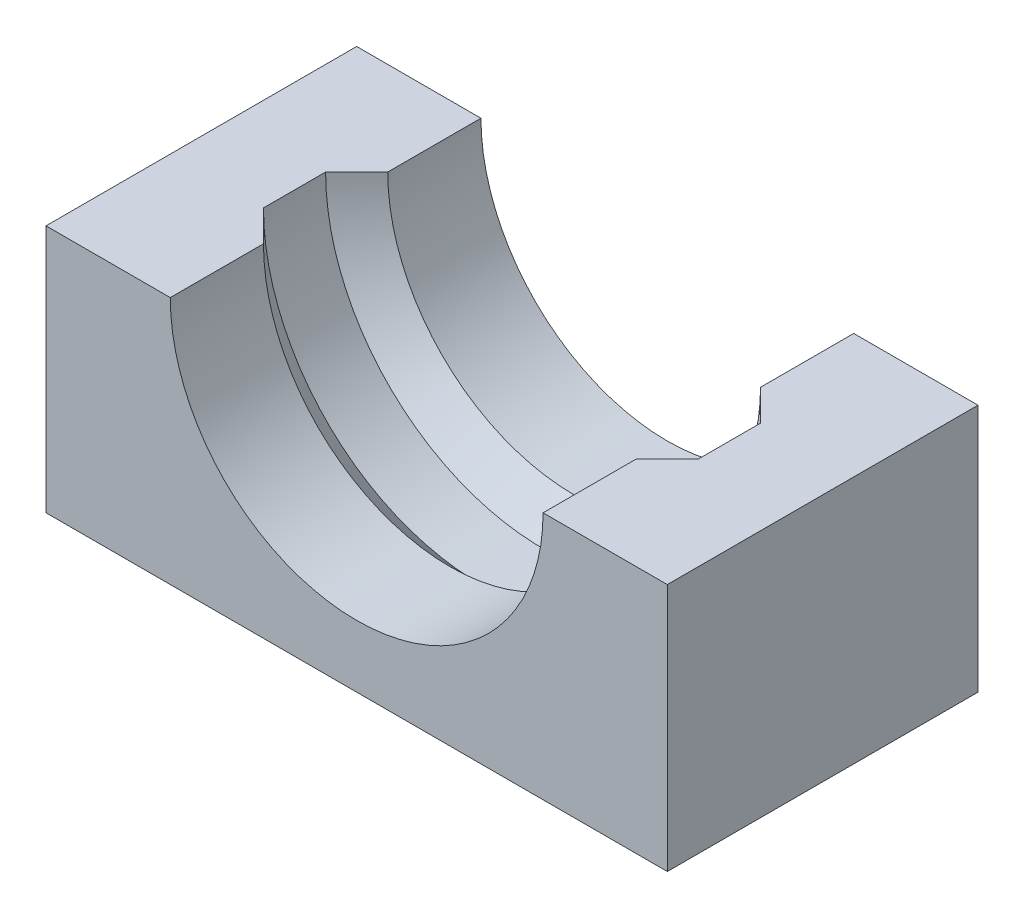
ISO-10303-21;
HEADER;
FILE_DESCRIPTION(('STEP AP214'),'2;1');
FILE_NAME('part.step','',(''),(''),'','','');
FILE_SCHEMA(('AUTOMOTIVE_DESIGN { 1 0 10303 214 1 1 1 1 }'));
ENDSEC;
DATA;
#1=APPLICATION_CONTEXT('core data for automotive mechanical design processes');
#2=APPLICATION_PROTOCOL_DEFINITION('international standard','automotive_design',2000,#1);
#3=PRODUCT_CONTEXT('',#1,'mechanical');
#4=PRODUCT('Part','Part','',(#3));
#5=PRODUCT_RELATED_PRODUCT_CATEGORY('part','',(#4));
#6=PRODUCT_DEFINITION_FORMATION('','',#4);
#7=PRODUCT_DEFINITION_CONTEXT('part definition',#1,'design');
#8=PRODUCT_DEFINITION('design','',#6,#7);
#9=PRODUCT_DEFINITION_SHAPE('','',#8);
#10=(LENGTH_UNIT() NAMED_UNIT(*) SI_UNIT(.MILLI.,.METRE.));
#11=(NAMED_UNIT(*) PLANE_ANGLE_UNIT() SI_UNIT($,.RADIAN.));
#12=(NAMED_UNIT(*) SI_UNIT($,.STERADIAN.) SOLID_ANGLE_UNIT());
#13=UNCERTAINTY_MEASURE_WITH_UNIT(LENGTH_MEASURE(1.E-05),#10,'distance_accuracy_value','');
#14=(GEOMETRIC_REPRESENTATION_CONTEXT(3) GLOBAL_UNCERTAINTY_ASSIGNED_CONTEXT((#13)) GLOBAL_UNIT_ASSIGNED_CONTEXT((#10,
#11,#12)) REPRESENTATION_CONTEXT('',''));
#15=CARTESIAN_POINT('',(0.,0.,0.));
#16=DIRECTION('',(0.,0.,1.));
#17=DIRECTION('',(1.,0.,0.));
#18=AXIS2_PLACEMENT_3D('',#15,#16,#17);
#19=CARTESIAN_POINT('',(50.,40.,25.));
#20=DIRECTION('',(0.,0.,-1.));
#21=DIRECTION('',(-1.,0.,0.));
#22=AXIS2_PLACEMENT_3D('',#19,#20,#21);
#23=CYLINDRICAL_SURFACE('',#22,30.);
#24=DIRECTION('',(0.,0.,-1.));
#25=VECTOR('',#24,1.);
#26=CARTESIAN_POINT('',(80.,40.,25.));
#27=LINE('',#26,#25);
#28=CARTESIAN_POINT('',(80.,40.,25.));
#29=VERTEX_POINT('',#28);
#30=CARTESIAN_POINT('',(80.,40.0000000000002,10.));
#31=VERTEX_POINT('',#30);
#32=EDGE_CURVE('E129',#29,#31,#27,.T.);
#33=ORIENTED_EDGE('',*,*,#32,.T.);
#34=CARTESIAN_POINT('',(50.,40.,10.));
#35=DIRECTION('',(0.,0.,-1.));
#36=DIRECTION('',(-1.,0.,0.));
#37=AXIS2_PLACEMENT_3D('',#34,#35,#36);
#38=CIRCLE('',#37,30.);
#39=CARTESIAN_POINT('',(20.,40.,10.));
#40=VERTEX_POINT('',#39);
#41=EDGE_CURVE('E114',#31,#40,#38,.T.);
#42=ORIENTED_EDGE('',*,*,#41,.T.);
#43=DIRECTION('',(0.,0.,-1.));
#44=VECTOR('',#43,1.);
#45=CARTESIAN_POINT('',(20.,40.,25.));
#46=LINE('',#45,#44);
#47=CARTESIAN_POINT('',(20.,40.,25.));
#48=VERTEX_POINT('',#47);
#49=EDGE_CURVE('E126',#48,#40,#46,.T.);
#50=ORIENTED_EDGE('',*,*,#49,.F.);
#51=CARTESIAN_POINT('',(50.,40.,25.));
#52=DIRECTION('',(0.,0.,-1.));
#53=DIRECTION('',(1.,0.,0.));
#54=AXIS2_PLACEMENT_3D('',#51,#52,#53);
#55=CIRCLE('',#54,30.);
#56=EDGE_CURVE('E177',#29,#48,#55,.T.);
#57=ORIENTED_EDGE('',*,*,#56,.F.);
#58=EDGE_LOOP('',(#33,#42,#50,#57));
#59=FACE_BOUND('',#58,.T.);
#60=ADVANCED_FACE('F33',(#59),#23,.F.);
#61=CARTESIAN_POINT('',(100.,0.,25.));
#62=DIRECTION('',(0.,1.,0.));
#63=DIRECTION('',(-1.,0.,0.));
#64=AXIS2_PLACEMENT_3D('',#61,#62,#63);
#65=PLANE('',#64);
#66=DIRECTION('',(1.,0.,0.));
#67=VECTOR('',#66,1.);
#68=CARTESIAN_POINT('',(100.,0.,-25.));
#69=LINE('',#68,#67);
#70=CARTESIAN_POINT('',(0.,0.,-25.));
#71=VERTEX_POINT('',#70);
#72=CARTESIAN_POINT('',(100.,0.,-25.));
#73=VERTEX_POINT('',#72);
#74=EDGE_CURVE('E130',#71,#73,#69,.T.);
#75=ORIENTED_EDGE('',*,*,#74,.T.);
#76=DIRECTION('',(0.,0.,-1.));
#77=VECTOR('',#76,1.);
#78=CARTESIAN_POINT('',(100.,0.,25.));
#79=LINE('',#78,#77);
#80=CARTESIAN_POINT('',(100.,0.,25.));
#81=VERTEX_POINT('',#80);
#82=EDGE_CURVE('E11',#81,#73,#79,.T.);
#83=ORIENTED_EDGE('',*,*,#82,.F.);
#84=DIRECTION('',(1.,0.,0.));
#85=VECTOR('',#84,1.);
#86=CARTESIAN_POINT('',(100.,0.,25.));
#87=LINE('',#86,#85);
#88=CARTESIAN_POINT('',(0.,0.,25.));
#89=VERTEX_POINT('',#88);
#90=EDGE_CURVE('E172',#89,#81,#87,.T.);
#91=ORIENTED_EDGE('',*,*,#90,.F.);
#92=DIRECTION('',(0.,0.,-1.));
#93=VECTOR('',#92,1.);
#94=CARTESIAN_POINT('',(0.,0.,25.));
#95=LINE('',#94,#93);
#96=EDGE_CURVE('E180',#89,#71,#95,.T.);
#97=ORIENTED_EDGE('',*,*,#96,.T.);
#98=EDGE_LOOP('',(#75,#83,#91,#97));
#99=FACE_BOUND('',#98,.T.);
#100=ADVANCED_FACE('F35',(#99),#65,.F.);
#101=CARTESIAN_POINT('',(100.,40.,25.));
#102=DIRECTION('',(-1.,0.,0.));
#103=DIRECTION('',(0.,0.,1.));
#104=AXIS2_PLACEMENT_3D('',#101,#102,#103);
#105=PLANE('',#104);
#106=DIRECTION('',(0.,1.,0.));
#107=VECTOR('',#106,1.);
#108=CARTESIAN_POINT('',(100.,40.,-25.));
#109=LINE('',#108,#107);
#110=CARTESIAN_POINT('',(100.,40.,-25.));
#111=VERTEX_POINT('',#110);
#112=EDGE_CURVE('E159',#73,#111,#109,.T.);
#113=ORIENTED_EDGE('',*,*,#112,.T.);
#114=DIRECTION('',(0.,0.,-1.));
#115=VECTOR('',#114,1.);
#116=CARTESIAN_POINT('',(100.,40.,25.));
#117=LINE('',#116,#115);
#118=CARTESIAN_POINT('',(100.,40.,25.));
#119=VERTEX_POINT('',#118);
#120=EDGE_CURVE('E41',#119,#111,#117,.T.);
#121=ORIENTED_EDGE('',*,*,#120,.F.);
#122=DIRECTION('',(0.,1.,0.));
#123=VECTOR('',#122,1.);
#124=CARTESIAN_POINT('',(100.,40.,25.));
#125=LINE('',#124,#123);
#126=EDGE_CURVE('E174',#81,#119,#125,.T.);
#127=ORIENTED_EDGE('',*,*,#126,.F.);
#128=ORIENTED_EDGE('',*,*,#82,.T.);
#129=EDGE_LOOP('',(#113,#121,#127,#128));
#130=FACE_BOUND('',#129,.T.);
#131=ADVANCED_FACE('F226',(#130),#105,.F.);
#132=CARTESIAN_POINT('',(80.,40.,25.));
#133=DIRECTION('',(0.,-1.,0.));
#134=DIRECTION('',(0.,0.,-1.));
#135=AXIS2_PLACEMENT_3D('',#132,#133,#134);
#136=PLANE('',#135);
#137=DIRECTION('',(0.,0.,1.));
#138=VECTOR('',#137,1.);
#139=CARTESIAN_POINT('',(85.,40.0000000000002,-5.));
#140=LINE('',#139,#138);
#141=CARTESIAN_POINT('',(85.,40.0000000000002,-5.));
#142=VERTEX_POINT('',#141);
#143=CARTESIAN_POINT('',(85.,40.0000000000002,5.));
#144=VERTEX_POINT('',#143);
#145=EDGE_CURVE('E195',#142,#144,#140,.T.);
#146=ORIENTED_EDGE('',*,*,#145,.T.);
#147=DIRECTION('',(-0.707106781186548,0.,0.707106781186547));
#148=VECTOR('',#147,1.);
#149=CARTESIAN_POINT('',(80.,40.0000000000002,10.));
#150=LINE('',#149,#148);
#151=EDGE_CURVE('E200',#144,#31,#150,.T.);
#152=ORIENTED_EDGE('',*,*,#151,.T.);
#153=ORIENTED_EDGE('',*,*,#32,.F.);
#154=DIRECTION('',(-1.,0.,0.));
#155=VECTOR('',#154,1.);
#156=CARTESIAN_POINT('',(80.,40.,25.));
#157=LINE('',#156,#155);
#158=EDGE_CURVE('E154',#119,#29,#157,.T.);
#159=ORIENTED_EDGE('',*,*,#158,.F.);
#160=ORIENTED_EDGE('',*,*,#120,.T.);
#161=DIRECTION('',(-1.,0.,0.));
#162=VECTOR('',#161,1.);
#163=CARTESIAN_POINT('',(80.,40.,-25.));
#164=LINE('',#163,#162);
#165=CARTESIAN_POINT('',(80.,40.,-25.));
#166=VERTEX_POINT('',#165);
#167=EDGE_CURVE('E152',#111,#166,#164,.T.);
#168=ORIENTED_EDGE('',*,*,#167,.T.);
#169=CARTESIAN_POINT('',(80.,40.0000000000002,-10.));
#170=VERTEX_POINT('',#169);
#171=EDGE_CURVE('E136',#170,#166,#27,.T.);
#172=ORIENTED_EDGE('',*,*,#171,.F.);
#173=DIRECTION('',(0.707106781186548,0.,0.707106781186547));
#174=VECTOR('',#173,1.);
#175=CARTESIAN_POINT('',(80.,40.0000000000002,-10.));
#176=LINE('',#175,#174);
#177=EDGE_CURVE('E197',#170,#142,#176,.T.);
#178=ORIENTED_EDGE('',*,*,#177,.T.);
#179=EDGE_LOOP('',(#146,#152,#153,#159,#160,#168,#172,#178));
#180=FACE_BOUND('',#179,.T.);
#181=ADVANCED_FACE('F150',(#180),#136,.F.);
#182=CARTESIAN_POINT('',(20.,40.,-10.));
#183=VERTEX_POINT('',#182);
#184=CARTESIAN_POINT('',(20.,40.,-25.));
#185=VERTEX_POINT('',#184);
#186=EDGE_CURVE('E137',#183,#185,#46,.T.);
#187=ORIENTED_EDGE('',*,*,#186,.F.);
#188=CARTESIAN_POINT('',(50.,40.,-10.));
#189=DIRECTION('',(0.,0.,-1.));
#190=DIRECTION('',(-1.,0.,0.));
#191=AXIS2_PLACEMENT_3D('',#188,#189,#190);
#192=CIRCLE('',#191,30.);
#193=EDGE_CURVE('E131',#170,#183,#192,.T.);
#194=ORIENTED_EDGE('',*,*,#193,.F.);
#195=ORIENTED_EDGE('',*,*,#171,.T.);
#196=CARTESIAN_POINT('',(50.,40.,-25.));
#197=DIRECTION('',(0.,0.,-1.));
#198=DIRECTION('',(1.,0.,0.));
#199=AXIS2_PLACEMENT_3D('',#196,#197,#198);
#200=CIRCLE('',#199,30.);
#201=EDGE_CURVE('E162',#166,#185,#200,.T.);
#202=ORIENTED_EDGE('',*,*,#201,.T.);
#203=EDGE_LOOP('',(#187,#194,#195,#202));
#204=FACE_BOUND('',#203,.T.);
#205=ADVANCED_FACE('F210',(#204),#23,.F.);
#206=CARTESIAN_POINT('',(0.,40.,25.));
#207=DIRECTION('',(0.,-1.,0.));
#208=DIRECTION('',(0.,0.,-1.));
#209=AXIS2_PLACEMENT_3D('',#206,#207,#208);
#210=PLANE('',#209);
#211=ORIENTED_EDGE('',*,*,#49,.T.);
#212=DIRECTION('',(0.707106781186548,0.,0.707106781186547));
#213=VECTOR('',#212,1.);
#214=CARTESIAN_POINT('',(20.,40.,10.));
#215=LINE('',#214,#213);
#216=CARTESIAN_POINT('',(15.,40.,5.));
#217=VERTEX_POINT('',#216);
#218=EDGE_CURVE('E110',#217,#40,#215,.T.);
#219=ORIENTED_EDGE('',*,*,#218,.F.);
#220=DIRECTION('',(0.,0.,1.));
#221=VECTOR('',#220,1.);
#222=CARTESIAN_POINT('',(15.,40.,-5.));
#223=LINE('',#222,#221);
#224=CARTESIAN_POINT('',(15.,40.,-5.));
#225=VERTEX_POINT('',#224);
#226=EDGE_CURVE('E202',#225,#217,#223,.T.);
#227=ORIENTED_EDGE('',*,*,#226,.F.);
#228=DIRECTION('',(-0.707106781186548,0.,0.707106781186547));
#229=VECTOR('',#228,1.);
#230=CARTESIAN_POINT('',(20.,40.,-10.));
#231=LINE('',#230,#229);
#232=EDGE_CURVE('E48',#183,#225,#231,.T.);
#233=ORIENTED_EDGE('',*,*,#232,.F.);
#234=ORIENTED_EDGE('',*,*,#186,.T.);
#235=DIRECTION('',(-1.,0.,0.));
#236=VECTOR('',#235,1.);
#237=CARTESIAN_POINT('',(0.,40.,-25.));
#238=LINE('',#237,#236);
#239=CARTESIAN_POINT('',(0.,40.,-25.));
#240=VERTEX_POINT('',#239);
#241=EDGE_CURVE('E164',#185,#240,#238,.T.);
#242=ORIENTED_EDGE('',*,*,#241,.T.);
#243=DIRECTION('',(0.,0.,-1.));
#244=VECTOR('',#243,1.);
#245=CARTESIAN_POINT('',(0.,40.,25.));
#246=LINE('',#245,#244);
#247=CARTESIAN_POINT('',(0.,40.,25.));
#248=VERTEX_POINT('',#247);
#249=EDGE_CURVE('E140',#248,#240,#246,.T.);
#250=ORIENTED_EDGE('',*,*,#249,.F.);
#251=DIRECTION('',(-1.,0.,0.));
#252=VECTOR('',#251,1.);
#253=CARTESIAN_POINT('',(0.,40.,25.));
#254=LINE('',#253,#252);
#255=EDGE_CURVE('E135',#48,#248,#254,.T.);
#256=ORIENTED_EDGE('',*,*,#255,.F.);
#257=EDGE_LOOP('',(#211,#219,#227,#233,#234,#242,#250,#256));
#258=FACE_BOUND('',#257,.T.);
#259=ADVANCED_FACE('F133',(#258),#210,.F.);
#260=CARTESIAN_POINT('',(0.,0.,25.));
#261=DIRECTION('',(1.,0.,0.));
#262=DIRECTION('',(0.,0.,-1.));
#263=AXIS2_PLACEMENT_3D('',#260,#261,#262);
#264=PLANE('',#263);
#265=DIRECTION('',(0.,-1.,0.));
#266=VECTOR('',#265,1.);
#267=CARTESIAN_POINT('',(0.,0.,-25.));
#268=LINE('',#267,#266);
#269=EDGE_CURVE('E170',#240,#71,#268,.T.);
#270=ORIENTED_EDGE('',*,*,#269,.T.);
#271=ORIENTED_EDGE('',*,*,#96,.F.);
#272=DIRECTION('',(0.,-1.,0.));
#273=VECTOR('',#272,1.);
#274=CARTESIAN_POINT('',(0.,0.,25.));
#275=LINE('',#274,#273);
#276=EDGE_CURVE('E56',#248,#89,#275,.T.);
#277=ORIENTED_EDGE('',*,*,#276,.F.);
#278=ORIENTED_EDGE('',*,*,#249,.T.);
#279=EDGE_LOOP('',(#270,#271,#277,#278));
#280=FACE_BOUND('',#279,.T.);
#281=ADVANCED_FACE('F188',(#280),#264,.F.);
#282=CARTESIAN_POINT('',(50.,40.,25.));
#283=DIRECTION('',(0.,0.,1.));
#284=DIRECTION('',(1.,0.,0.));
#285=AXIS2_PLACEMENT_3D('',#282,#283,#284);
#286=PLANE('',#285);
#287=ORIENTED_EDGE('',*,*,#90,.T.);
#288=ORIENTED_EDGE('',*,*,#126,.T.);
#289=ORIENTED_EDGE('',*,*,#158,.T.);
#290=ORIENTED_EDGE('',*,*,#56,.T.);
#291=ORIENTED_EDGE('',*,*,#255,.T.);
#292=ORIENTED_EDGE('',*,*,#276,.T.);
#293=EDGE_LOOP('',(#287,#288,#289,#290,#291,#292));
#294=FACE_BOUND('',#293,.T.);
#295=ADVANCED_FACE('F239',(#294),#286,.T.);
#296=CARTESIAN_POINT('',(50.,40.,-25.));
#297=DIRECTION('',(0.,0.,1.));
#298=DIRECTION('',(1.,0.,0.));
#299=AXIS2_PLACEMENT_3D('',#296,#297,#298);
#300=PLANE('',#299);
#301=ORIENTED_EDGE('',*,*,#74,.F.);
#302=ORIENTED_EDGE('',*,*,#269,.F.);
#303=ORIENTED_EDGE('',*,*,#241,.F.);
#304=ORIENTED_EDGE('',*,*,#201,.F.);
#305=ORIENTED_EDGE('',*,*,#167,.F.);
#306=ORIENTED_EDGE('',*,*,#112,.F.);
#307=EDGE_LOOP('',(#301,#302,#303,#304,#305,#306));
#308=FACE_BOUND('',#307,.T.);
#309=ADVANCED_FACE('F158',(#308),#300,.F.);
#310=CARTESIAN_POINT('',(50.,40.,5.));
#311=DIRECTION('',(0.,0.,-1.));
#312=DIRECTION('',(-1.,0.,0.));
#313=AXIS2_PLACEMENT_3D('',#310,#311,#312);
#314=CONICAL_SURFACE('',#313,35.,0.785398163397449);
#315=ORIENTED_EDGE('',*,*,#41,.F.);
#316=ORIENTED_EDGE('',*,*,#151,.F.);
#317=CARTESIAN_POINT('',(50.,40.,5.));
#318=DIRECTION('',(0.,0.,-1.));
#319=DIRECTION('',(-1.,0.,0.));
#320=AXIS2_PLACEMENT_3D('',#317,#318,#319);
#321=CIRCLE('',#320,35.);
#322=EDGE_CURVE('E116',#144,#217,#321,.T.);
#323=ORIENTED_EDGE('',*,*,#322,.T.);
#324=ORIENTED_EDGE('',*,*,#218,.T.);
#325=EDGE_LOOP('',(#315,#316,#323,#324));
#326=FACE_BOUND('',#325,.T.);
#327=ADVANCED_FACE('F112',(#326),#314,.F.);
#328=CARTESIAN_POINT('',(50.,40.,-10.));
#329=DIRECTION('',(0.,0.,1.));
#330=DIRECTION('',(1.,0.,0.));
#331=AXIS2_PLACEMENT_3D('',#328,#329,#330);
#332=CONICAL_SURFACE('',#331,30.,0.785398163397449);
#333=CARTESIAN_POINT('',(50.,40.,-5.));
#334=DIRECTION('',(0.,0.,-1.));
#335=DIRECTION('',(-1.,0.,0.));
#336=AXIS2_PLACEMENT_3D('',#333,#334,#335);
#337=CIRCLE('',#336,35.);
#338=EDGE_CURVE('E192',#142,#225,#337,.T.);
#339=ORIENTED_EDGE('',*,*,#338,.F.);
#340=ORIENTED_EDGE('',*,*,#177,.F.);
#341=ORIENTED_EDGE('',*,*,#193,.T.);
#342=ORIENTED_EDGE('',*,*,#232,.T.);
#343=EDGE_LOOP('',(#339,#340,#341,#342));
#344=FACE_BOUND('',#343,.T.);
#345=ADVANCED_FACE('F211',(#344),#332,.F.);
#346=CARTESIAN_POINT('',(50.,40.,-25.));
#347=DIRECTION('',(0.,0.,-1.));
#348=DIRECTION('',(-1.,0.,0.));
#349=AXIS2_PLACEMENT_3D('',#346,#347,#348);
#350=CYLINDRICAL_SURFACE('',#349,35.);
#351=ORIENTED_EDGE('',*,*,#145,.F.);
#352=ORIENTED_EDGE('',*,*,#338,.T.);
#353=ORIENTED_EDGE('',*,*,#226,.T.);
#354=ORIENTED_EDGE('',*,*,#322,.F.);
#355=EDGE_LOOP('',(#351,#352,#353,#354));
#356=FACE_BOUND('',#355,.T.);
#357=ADVANCED_FACE('F206',(#356),#350,.F.);
#358=CLOSED_SHELL('',(#60,#100,#131,#181,#205,#259,#281,#295,#309,#327,#345,#357));
#359=MANIFOLD_SOLID_BREP('B2',#358);
#360=ADVANCED_BREP_SHAPE_REPRESENTATION('',(#18,#359),#14);
#361=SHAPE_DEFINITION_REPRESENTATION(#9,#360);
ENDSEC;
END-ISO-10303-21;
